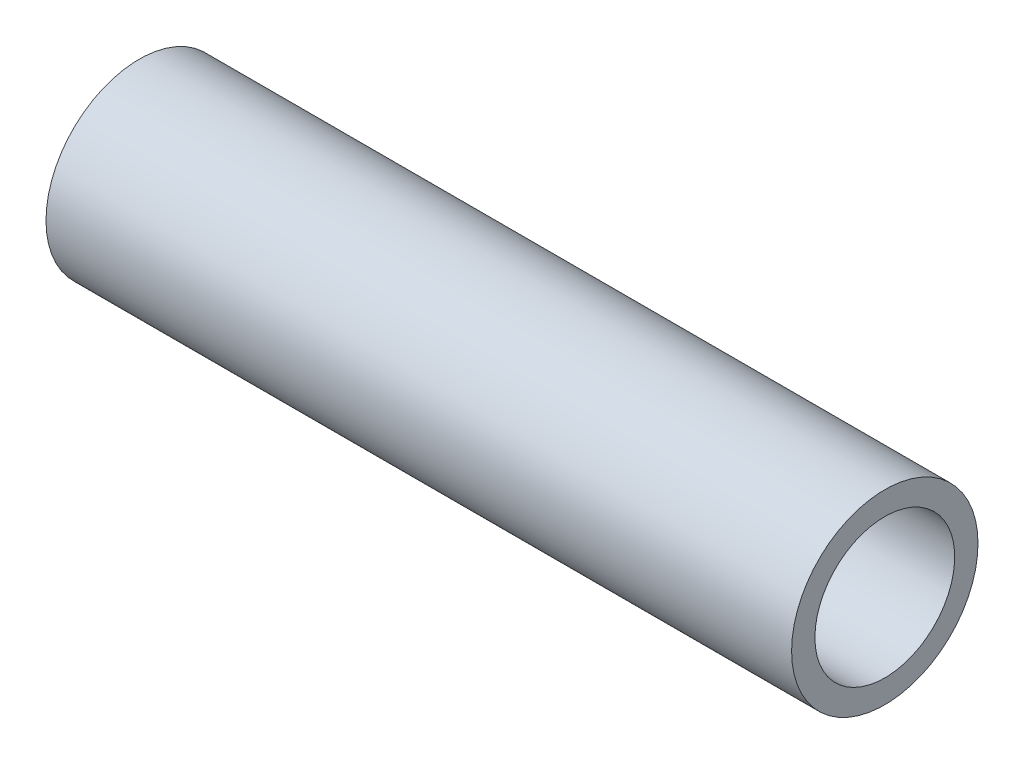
ISO-10303-21;
HEADER;
FILE_DESCRIPTION(('STEP AP214'),'2;1');
FILE_NAME('part.step','',(''),(''),'','','');
FILE_SCHEMA(('AUTOMOTIVE_DESIGN { 1 0 10303 214 1 1 1 1 }'));
ENDSEC;
DATA;
#1=APPLICATION_CONTEXT('core data for automotive mechanical design processes');
#2=APPLICATION_PROTOCOL_DEFINITION('international standard','automotive_design',2000,#1);
#3=PRODUCT_CONTEXT('',#1,'mechanical');
#4=PRODUCT('Part','Part','',(#3));
#5=PRODUCT_RELATED_PRODUCT_CATEGORY('part','',(#4));
#6=PRODUCT_DEFINITION_FORMATION('','',#4);
#7=PRODUCT_DEFINITION_CONTEXT('part definition',#1,'design');
#8=PRODUCT_DEFINITION('design','',#6,#7);
#9=PRODUCT_DEFINITION_SHAPE('','',#8);
#10=(LENGTH_UNIT() NAMED_UNIT(*) SI_UNIT(.MILLI.,.METRE.));
#11=(NAMED_UNIT(*) PLANE_ANGLE_UNIT() SI_UNIT($,.RADIAN.));
#12=(NAMED_UNIT(*) SI_UNIT($,.STERADIAN.) SOLID_ANGLE_UNIT());
#13=UNCERTAINTY_MEASURE_WITH_UNIT(LENGTH_MEASURE(1.E-05),#10,'distance_accuracy_value','');
#14=(GEOMETRIC_REPRESENTATION_CONTEXT(3) GLOBAL_UNCERTAINTY_ASSIGNED_CONTEXT((#13)) GLOBAL_UNIT_ASSIGNED_CONTEXT((#10,
#11,#12)) REPRESENTATION_CONTEXT('',''));
#15=CARTESIAN_POINT('',(0.,0.,0.));
#16=DIRECTION('',(0.,0.,1.));
#17=DIRECTION('',(1.,0.,0.));
#18=AXIS2_PLACEMENT_3D('',#15,#16,#17);
#19=CARTESIAN_POINT('',(25.4,0.,0.));
#20=DIRECTION('',(-1.,0.,0.));
#21=DIRECTION('',(0.,0.,1.));
#22=AXIS2_PLACEMENT_3D('',#19,#20,#21);
#23=CYLINDRICAL_SURFACE('',#22,3.175);
#24=CARTESIAN_POINT('',(25.4,0.,0.));
#25=DIRECTION('',(1.,0.,0.));
#26=DIRECTION('',(0.,0.,-1.));
#27=AXIS2_PLACEMENT_3D('',#24,#25,#26);
#28=CIRCLE('',#27,3.175);
#29=CARTESIAN_POINT('',(25.4,0.,-3.175));
#30=VERTEX_POINT('',#29);
#31=EDGE_CURVE('E10',#30,#30,#28,.T.);
#32=ORIENTED_EDGE('',*,*,#31,.F.);
#33=EDGE_LOOP('',(#32));
#34=FACE_BOUND('',#33,.T.);
#35=CARTESIAN_POINT('',(0.,0.,0.));
#36=DIRECTION('',(1.,0.,0.));
#37=DIRECTION('',(0.,0.,-1.));
#38=AXIS2_PLACEMENT_3D('',#35,#36,#37);
#39=CIRCLE('',#38,3.175);
#40=CARTESIAN_POINT('',(0.,0.,-3.175));
#41=VERTEX_POINT('',#40);
#42=EDGE_CURVE('E36',#41,#41,#39,.T.);
#43=ORIENTED_EDGE('',*,*,#42,.T.);
#44=EDGE_LOOP('',(#43));
#45=FACE_BOUND('',#44,.T.);
#46=ADVANCED_FACE('F33',(#34,#45),#23,.T.);
#47=CARTESIAN_POINT('',(25.4,0.,0.));
#48=DIRECTION('',(1.,0.,0.));
#49=DIRECTION('',(0.,0.,-1.));
#50=AXIS2_PLACEMENT_3D('',#47,#48,#49);
#51=PLANE('',#50);
#52=CARTESIAN_POINT('',(25.4,0.,0.));
#53=DIRECTION('',(-1.,0.,0.));
#54=DIRECTION('',(0.,0.,1.));
#55=AXIS2_PLACEMENT_3D('',#52,#53,#54);
#56=CIRCLE('',#55,2.38125);
#57=CARTESIAN_POINT('',(25.4,0.,2.38125));
#58=VERTEX_POINT('',#57);
#59=EDGE_CURVE('E43',#58,#58,#56,.T.);
#60=ORIENTED_EDGE('',*,*,#59,.T.);
#61=EDGE_LOOP('',(#60));
#62=FACE_BOUND('',#61,.T.);
#63=ORIENTED_EDGE('',*,*,#31,.T.);
#64=EDGE_LOOP('',(#63));
#65=FACE_BOUND('',#64,.T.);
#66=ADVANCED_FACE('F51',(#62,#65),#51,.T.);
#67=CARTESIAN_POINT('',(0.,0.,0.));
#68=DIRECTION('',(1.,0.,0.));
#69=DIRECTION('',(0.,0.,-1.));
#70=AXIS2_PLACEMENT_3D('',#67,#68,#69);
#71=PLANE('',#70);
#72=CARTESIAN_POINT('',(0.,0.,0.));
#73=DIRECTION('',(-1.,0.,0.));
#74=DIRECTION('',(0.,0.,1.));
#75=AXIS2_PLACEMENT_3D('',#72,#73,#74);
#76=CIRCLE('',#75,2.38125);
#77=CARTESIAN_POINT('',(0.,0.,2.38125));
#78=VERTEX_POINT('',#77);
#79=EDGE_CURVE('E45',#78,#78,#76,.T.);
#80=ORIENTED_EDGE('',*,*,#79,.F.);
#81=EDGE_LOOP('',(#80));
#82=FACE_BOUND('',#81,.T.);
#83=ORIENTED_EDGE('',*,*,#42,.F.);
#84=EDGE_LOOP('',(#83));
#85=FACE_BOUND('',#84,.T.);
#86=ADVANCED_FACE('F56',(#82,#85),#71,.F.);
#87=CARTESIAN_POINT('',(25.4,0.,0.));
#88=DIRECTION('',(-1.,0.,0.));
#89=DIRECTION('',(0.,0.,1.));
#90=AXIS2_PLACEMENT_3D('',#87,#88,#89);
#91=CYLINDRICAL_SURFACE('',#90,2.38125);
#92=ORIENTED_EDGE('',*,*,#59,.F.);
#93=EDGE_LOOP('',(#92));
#94=FACE_BOUND('',#93,.T.);
#95=ORIENTED_EDGE('',*,*,#79,.T.);
#96=EDGE_LOOP('',(#95));
#97=FACE_BOUND('',#96,.T.);
#98=ADVANCED_FACE('F53',(#94,#97),#91,.F.);
#99=CLOSED_SHELL('',(#46,#66,#86,#98));
#100=MANIFOLD_SOLID_BREP('B2',#99);
#101=ADVANCED_BREP_SHAPE_REPRESENTATION('',(#18,#100),#14);
#102=SHAPE_DEFINITION_REPRESENTATION(#9,#101);
ENDSEC;
END-ISO-10303-21;
